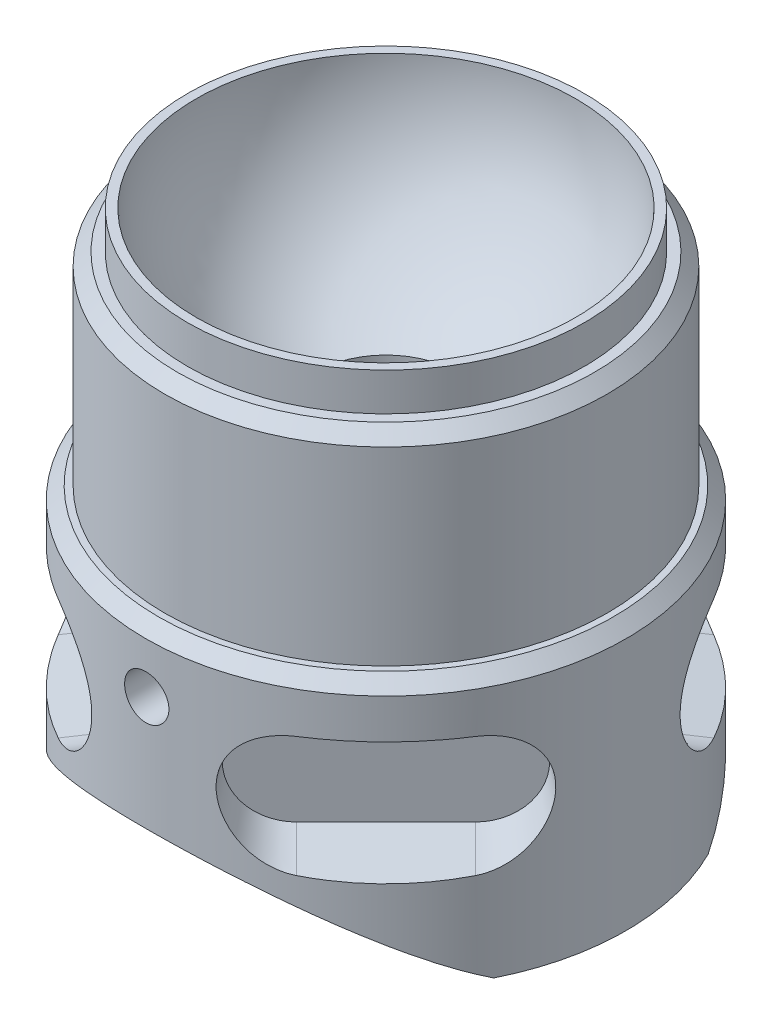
from build123d import *

# Parameters (mm, degrees)
SCHIZZO1_R                         = 19
ESTRUSIONE1_DEPTH                  = 40
SCHIZZO2_R                         = 5.5
TAGLIO_ESTRUSIONE1_DEPTH           = 49.187135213
SCHIZZO4_R                         = 25.7
SCHIZZO4_R_2                       = 15.7
TAGLIO_ESTRUSIONE2_DEPTH           = 3
SCHIZZO5_R                         = 27.5
SCHIZZO5_R_2                       = 17.5
TAGLIO_ESTRUSIONE3_DEPTH           = 16
SCHIZZO6_R                         = 12
SCHIZZO6_R_2                       = 7.25
TAGLIO_ESTRUSIONE4_DEPTH           = 11
TAGLIO_ESTRUSIONE5_DEPTH           = 49.187135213
TAGLIO_ESTRUSIONE5_DEPTH_BACK      = 49.187135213
SCHIZZO7_R                         = 24.15
ESTRUSIONE2_REACH                  = 50.187
SCHIZZO8_R                         = 7.25
SCHIZZO8_R_2                       = 5.5
TAGLIO_ESTRUSIONE6_DEPTH           = 6
TAGLIO_ESTRUSIONE6_DRAFT           = -8
RIPETIZIONECIRCOLARE1_COPY_1_DEPTH = 6
RIPETIZIONECIRCOLARE1_COPY_1_DRAFT = -8
RIPETIZIONECIRCOLARE1_COPY_2_DEPTH = 6
RIPETIZIONECIRCOLARE1_COPY_2_DRAFT = -8
RIPETIZIONECIRCOLARE1_COPY_3_DEPTH = 6
RIPETIZIONECIRCOLARE1_COPY_3_DRAFT = -8
SCHIZZO10_R                        = 1.75
TAGLIO_ESTRUSIONE7_DEPTH           = 17
SMUSSO1_SIZE                       = 1


with BuildPart() as part:
    # Schizzo1 → Estrusione1 (new body)
    with BuildSketch(Plane(origin=(0, 0, 0), x_dir=(1, 0, 0), z_dir=(0, 1, 0))):
        with Locations(Location((0, 0, 0), (0, 0, 270))):
            Circle(SCHIZZO1_R)
    extrude(amount=ESTRUSIONE1_DEPTH)

    # Schizzo2 → Taglio-Estrusione1 (cut, through all)
    with BuildSketch(Plane(origin=(0, 40, 0), x_dir=(-1, 0, 0), z_dir=(0, 1, 0))):
        with Locations(Location((0, 0, 0), (0, 0, 90))):
            Circle(SCHIZZO2_R)
    extrude(amount=-TAGLIO_ESTRUSIONE1_DEPTH, mode=Mode.SUBTRACT)

    # Schizzo3 → Taglia-Rivoluzione1 (revolve, cut)
    with BuildSketch(Plane.XY):
        with BuildLine():
            Line((0, 55), (0, 25))
            ThreePointArc((0, 25), (15, 40), (0, 55))
        make_face()
    revolve(axis=Axis((0, 40, 0), (0, -1, 0)), mode=Mode.SUBTRACT)

    # Schizzo4 → Taglio-Estrusione2 (cut)
    with BuildSketch(Plane(origin=(0, 40, 0), x_dir=(-1, 0, 0), z_dir=(0, 1, 0))):
        Circle(SCHIZZO4_R)
        with Locations(Location((0, 0, 0), (0, 0, 90))):
            Circle(SCHIZZO4_R_2, mode=Mode.SUBTRACT)
    extrude(amount=-TAGLIO_ESTRUSIONE2_DEPTH, mode=Mode.SUBTRACT)

    # Schizzo5 → Taglio-Estrusione3 (cut)
    with BuildSketch(Plane(origin=(0, 37, 0), x_dir=(-1, 0, 0), z_dir=(0, 1, 0))):
        Circle(SCHIZZO5_R)
        with Locations(Location((0, 0, 0), (0, 0, 90))):
            Circle(SCHIZZO5_R_2, mode=Mode.SUBTRACT)
    extrude(amount=-TAGLIO_ESTRUSIONE3_DEPTH, mode=Mode.SUBTRACT)

    # Schizzo6 → Taglio-Estrusione4 (cut)
    with BuildSketch(Plane.XZ):
        with Locations(Location((0, 0, 0), (0, 0, 270))):
            Circle(SCHIZZO6_R)
        with Locations(Location((0, 0, 0), (0, 0, 270))):
            Circle(SCHIZZO6_R_2, mode=Mode.SUBTRACT)
    extrude(amount=-TAGLIO_ESTRUSIONE4_DEPTH, mode=Mode.SUBTRACT)

    # Schizzo7 → Taglio-Estrusione5 (cut, two sides: drawn at the far end of the back side and taken through both)
    with BuildSketch(Plane.XY.offset(-TAGLIO_ESTRUSIONE5_DEPTH_BACK)):
        with Locations((0, -17.15)):
            Circle(SCHIZZO7_R)
    extrude(amount=TAGLIO_ESTRUSIONE5_DEPTH + TAGLIO_ESTRUSIONE5_DEPTH_BACK, mode=Mode.SUBTRACT)

    # Schizzo8 → Estrusione2 (add, up to next)
    with BuildSketch(Plane(origin=(0, 0, 0), x_dir=(1, 0, 0), z_dir=(0, 1, 0)), mode=Mode.PRIVATE) as estrusione2_sk1:
        with Locations(Location((0, 0, 0), (0, 0, 90))):
            Circle(SCHIZZO8_R)
        with Locations(Location((0, 0, 0), (0, 0, 270))):
            Circle(SCHIZZO8_R_2, mode=Mode.SUBTRACT)
    estrusione2_tool1 = extrude(estrusione2_sk1.sketch, amount=ESTRUSIONE2_REACH, mode=Mode.PRIVATE) - part.part
    add(estrusione2_tool1.solids().sort_by_distance((0, 0, 7.044939))[0])


with BuildPart() as taglio_estrusione6_tool:
    # Schizzo9 → Taglio-Estrusione6 (with draft: the straight prism first)
    with BuildSketch(Plane(origin=(14.142135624, 0, 14.142135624), x_dir=(0.7071067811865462, 0, -0.7071067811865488), z_dir=(0.7071067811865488, 0, 0.7071067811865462))):
        with BuildLine():
            ThreePointArc((-5, 17), (-10, 12), (-5, 7))
            Line((-5, 7), (5, 7))
            ThreePointArc((5, 7), (10, 12), (5, 17))
            Line((5, 17), (-5, 17))
        make_face()
    extrude(amount=-TAGLIO_ESTRUSIONE6_DEPTH)
    # Taglio-Estrusione6: the draft: its side faces are tilted about the plane it starts from
    taglio_estrusione6_sides = [taglio_estrusione6_tool.faces().sort_by_distance(p)[0] for p in [
        (4.949747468, 12, 19.091883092),
        (12.02081528, 7, 12.02081528),
        (19.091883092, 12, 4.949747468),
        (12.02081528, 17, 12.02081528),
    ]]
    draft(taglio_estrusione6_sides, Plane(origin=(14.142135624, 0, 14.142135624), x_dir=(0.7071067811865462, 0, -0.7071067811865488), z_dir=(0.7071067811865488, 0, 0.7071067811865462)), TAGLIO_ESTRUSIONE6_DRAFT)


with BuildPart() as part_1:
    add(part.part)

    # Taglio-Estrusione6: cut by taglio_estrusione6_tool
    add(taglio_estrusione6_tool.part, mode=Mode.SUBTRACT)


with BuildPart() as ripetizionecircolare1_copy_1_tool:
    # RipetizioneCircolare1 copy 1 sketch → RipetizioneCircolare1 copy 1 (with draft: the straight prism first)
    with BuildSketch(Plane(origin=(14.142135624, 0, -14.142135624), x_dir=(-0.7071067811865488, 0, -0.7071067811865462), z_dir=(0.7071067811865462, 0, -0.7071067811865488))):
        with BuildLine():
            ThreePointArc((-5, 17), (-10, 12), (-5, 7))
            Line((-5, 7), (5, 7))
            ThreePointArc((5, 7), (10, 12), (5, 17))
            Line((5, 17), (-5, 17))
        make_face()
    extrude(amount=-RIPETIZIONECIRCOLARE1_COPY_1_DEPTH)
    # RipetizioneCircolare1 copy 1: the draft: its side faces are tilted about the plane it starts from
    ripetizionecircolare1_copy_1_sides = [ripetizionecircolare1_copy_1_tool.faces().sort_by_distance(p)[0] for p in [
        (19.091883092, 12, -4.949747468),
        (12.02081528, 7, -12.02081528),
        (4.949747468, 12, -19.091883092),
        (12.02081528, 17, -12.02081528),
    ]]
    draft(ripetizionecircolare1_copy_1_sides, Plane(origin=(14.142135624, 0, -14.142135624), x_dir=(-0.7071067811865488, 0, -0.7071067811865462), z_dir=(0.7071067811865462, 0, -0.7071067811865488)), RIPETIZIONECIRCOLARE1_COPY_1_DRAFT)


with BuildPart() as part_2:
    add(part_1.part)

    # RipetizioneCircolare1 copy 1: cut by ripetizionecircolare1_copy_1_tool
    add(ripetizionecircolare1_copy_1_tool.part, mode=Mode.SUBTRACT)


with BuildPart() as ripetizionecircolare1_copy_2_tool:
    # RipetizioneCircolare1 copy 2 sketch → RipetizioneCircolare1 copy 2 (with draft: the straight prism first)
    with BuildSketch(Plane(origin=(-14.142135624, 0, -14.142135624), x_dir=(-0.7071067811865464, 0, 0.7071067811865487), z_dir=(-0.7071067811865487, 0, -0.7071067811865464))):
        with BuildLine():
            ThreePointArc((-5, 17), (-10, 12), (-5, 7))
            Line((-5, 7), (5, 7))
            ThreePointArc((5, 7), (10, 12), (5, 17))
            Line((5, 17), (-5, 17))
        make_face()
    extrude(amount=-RIPETIZIONECIRCOLARE1_COPY_2_DEPTH)
    # RipetizioneCircolare1 copy 2: the draft: its side faces are tilted about the plane it starts from
    ripetizionecircolare1_copy_2_sides = [ripetizionecircolare1_copy_2_tool.faces().sort_by_distance(p)[0] for p in [
        (-4.949747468, 12, -19.091883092),
        (-12.02081528, 7, -12.02081528),
        (-19.091883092, 12, -4.949747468),
        (-12.02081528, 17, -12.02081528),
    ]]
    draft(ripetizionecircolare1_copy_2_sides, Plane(origin=(-14.142135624, 0, -14.142135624), x_dir=(-0.7071067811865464, 0, 0.7071067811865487), z_dir=(-0.7071067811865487, 0, -0.7071067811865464)), RIPETIZIONECIRCOLARE1_COPY_2_DRAFT)


with BuildPart() as part_3:
    add(part_2.part)

    # RipetizioneCircolare1 copy 2: cut by ripetizionecircolare1_copy_2_tool
    add(ripetizionecircolare1_copy_2_tool.part, mode=Mode.SUBTRACT)


with BuildPart() as ripetizionecircolare1_copy_3_tool:
    # RipetizioneCircolare1 copy 3 sketch → RipetizioneCircolare1 copy 3 (with draft: the straight prism first)
    with BuildSketch(Plane(origin=(-14.142135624, 0, 14.142135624), x_dir=(0.7071067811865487, 0, 0.7071067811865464), z_dir=(-0.7071067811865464, 0, 0.7071067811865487))):
        with BuildLine():
            ThreePointArc((-5, 17), (-10, 12), (-5, 7))
            Line((-5, 7), (5, 7))
            ThreePointArc((5, 7), (10, 12), (5, 17))
            Line((5, 17), (-5, 17))
        make_face()
    extrude(amount=-RIPETIZIONECIRCOLARE1_COPY_3_DEPTH)
    # RipetizioneCircolare1 copy 3: the draft: its side faces are tilted about the plane it starts from
    ripetizionecircolare1_copy_3_sides = [ripetizionecircolare1_copy_3_tool.faces().sort_by_distance(p)[0] for p in [
        (-19.091883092, 12, 4.949747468),
        (-12.02081528, 7, 12.02081528),
        (-4.949747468, 12, 19.091883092),
        (-12.02081528, 17, 12.02081528),
    ]]
    draft(ripetizionecircolare1_copy_3_sides, Plane(origin=(-14.142135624, 0, 14.142135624), x_dir=(0.7071067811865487, 0, 0.7071067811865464), z_dir=(-0.7071067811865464, 0, 0.7071067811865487)), RIPETIZIONECIRCOLARE1_COPY_3_DRAFT)


with BuildPart() as part_4:
    add(part_3.part)

    # RipetizioneCircolare1 copy 3: cut by ripetizionecircolare1_copy_3_tool
    add(ripetizionecircolare1_copy_3_tool.part, mode=Mode.SUBTRACT)

    # Schizzo10 → Taglio-Estrusione7 (cut)
    with BuildSketch(Plane.XY.offset(-25)):
        with Locations(Location((0, 16, 0), (0, 0, 90))):
            Circle(SCHIZZO10_R)
    taglio_estrusione7 = extrude(amount=TAGLIO_ESTRUSIONE7_DEPTH, mode=Mode.SUBTRACT)

    # Smusso1
    smusso1_edges = [part_4.edges().sort_by_distance(p)[0] for p in [
        (0, 21, -19),
        (0, 37, -17.5),
    ]]
    chamfer(smusso1_edges, length=SMUSSO1_SIZE)

    # Specchia3: Taglio-Estrusione7 across plane
    add(taglio_estrusione7.mirror(Plane.XY), mode=Mode.SUBTRACT)


solid = part_4.part
